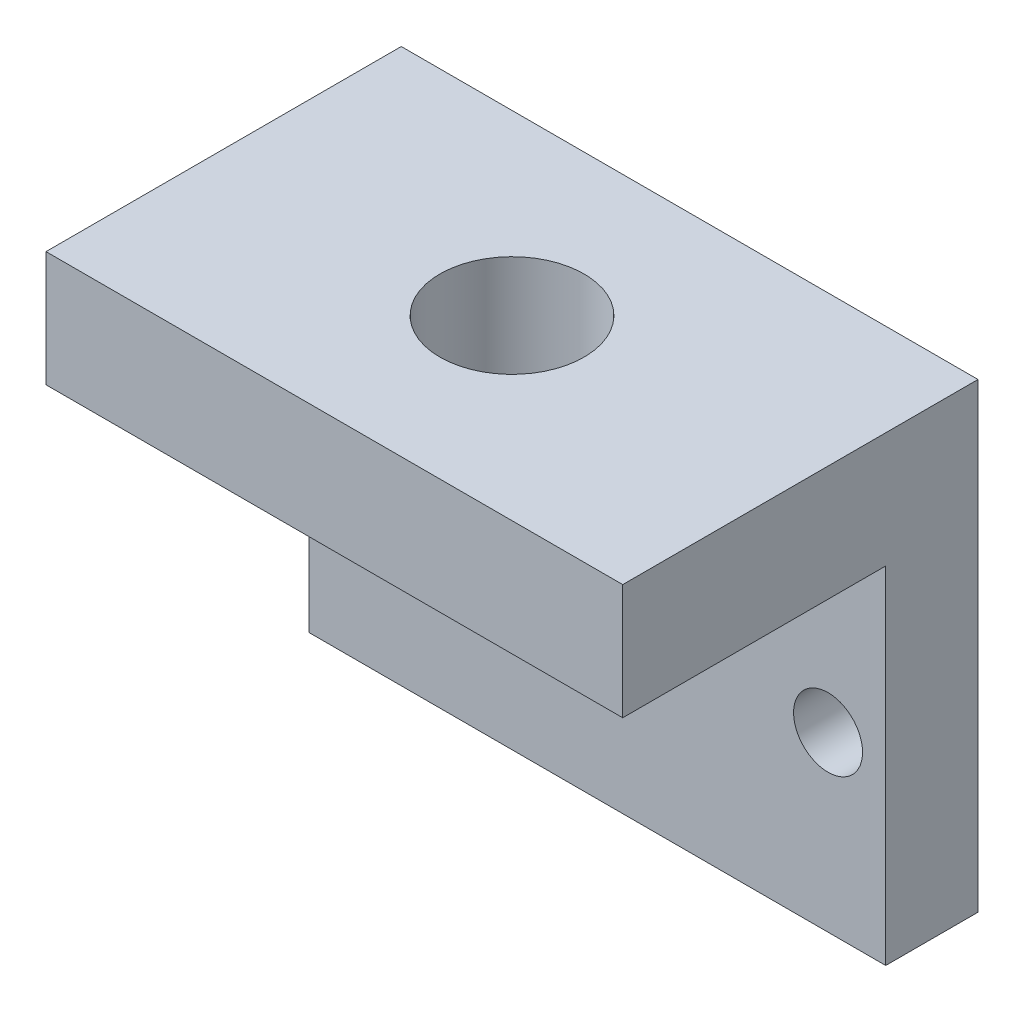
from build123d import *

# Parameters (mm, degrees)
SKETCH1_W                                      = 31.75
SKETCH1_H                                      = 19.558
SKETCH1_R                                      = 3.96875
EXTRUDE1_DEPTH                                 = 6.35
SKETCH2_W                                      = 31.75
SKETCH2_H                                      = 19.558
EXTRUDE2_DEPTH                                 = 19.05
CBORE_FOR_6_SOCKET_HEAD_CAP_SCREW1_D           = 3.7973
CBORE_FOR_6_SOCKET_HEAD_CAP_SCREW1_CBORE_D     = 7.14502
CBORE_FOR_6_SOCKET_HEAD_CAP_SCREW1_CBORE_DEPTH = 12.7
SKETCH6_W                                      = 14.478
SKETCH6_H                                      = 19.05
CUT_EXTRUDE2_DEPTH                             = 39.296133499


with BuildPart() as part:
    # Sketch1 → Extrude1 (new body)
    with BuildSketch(Plane(origin=(0, 0, 0), x_dir=(1, 0, 0), z_dir=(0, 1, 0))):
        Rectangle(SKETCH1_W, SKETCH1_H)
        with Locations(Location((0, 0, 0), (0, 0, 270))):
            Circle(SKETCH1_R, mode=Mode.SUBTRACT)
    extrude(amount=EXTRUDE1_DEPTH)

    # Sketch2 → Extrude2 (add)
    with BuildSketch(Plane.XZ):
        Rectangle(SKETCH2_W, SKETCH2_H)
    extrude(amount=EXTRUDE2_DEPTH)

    # CBORE for _6 Socket Head Cap Screw1 (through all)
    with Locations(Plane.XY.offset(9.779)):
        with Locations((12.7, -9.525), (-12.7, -9.525)):
            CounterBoreHole(CBORE_FOR_6_SOCKET_HEAD_CAP_SCREW1_D / 2, CBORE_FOR_6_SOCKET_HEAD_CAP_SCREW1_CBORE_D / 2, CBORE_FOR_6_SOCKET_HEAD_CAP_SCREW1_CBORE_DEPTH)

    # Sketch6 → Cut-Extrude2 (cut, through all)
    with BuildSketch(Plane.ZY.offset(15.875)):
        with Locations((2.54, -9.525)):
            Rectangle(SKETCH6_W, SKETCH6_H)
    extrude(amount=-CUT_EXTRUDE2_DEPTH, mode=Mode.SUBTRACT)


solid = part.part
